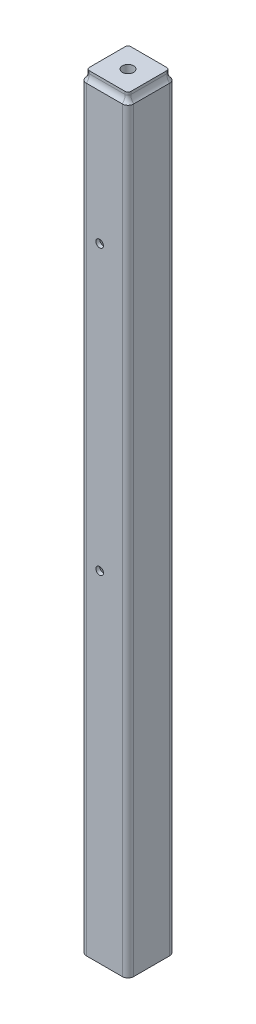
ISO-10303-21;
HEADER;
FILE_DESCRIPTION(('STEP AP214'),'2;1');
FILE_NAME('part.step','',(''),(''),'','','');
FILE_SCHEMA(('AUTOMOTIVE_DESIGN { 1 0 10303 214 1 1 1 1 }'));
ENDSEC;
DATA;
#1=APPLICATION_CONTEXT('core data for automotive mechanical design processes');
#2=APPLICATION_PROTOCOL_DEFINITION('international standard','automotive_design',2000,#1);
#3=PRODUCT_CONTEXT('',#1,'mechanical');
#4=PRODUCT('Part','Part','',(#3));
#5=PRODUCT_RELATED_PRODUCT_CATEGORY('part','',(#4));
#6=PRODUCT_DEFINITION_FORMATION('','',#4);
#7=PRODUCT_DEFINITION_CONTEXT('part definition',#1,'design');
#8=PRODUCT_DEFINITION('design','',#6,#7);
#9=PRODUCT_DEFINITION_SHAPE('','',#8);
#10=(LENGTH_UNIT() NAMED_UNIT(*) SI_UNIT(.MILLI.,.METRE.));
#11=(NAMED_UNIT(*) PLANE_ANGLE_UNIT() SI_UNIT($,.RADIAN.));
#12=(NAMED_UNIT(*) SI_UNIT($,.STERADIAN.) SOLID_ANGLE_UNIT());
#13=UNCERTAINTY_MEASURE_WITH_UNIT(LENGTH_MEASURE(1.E-05),#10,'distance_accuracy_value','');
#14=(GEOMETRIC_REPRESENTATION_CONTEXT(3) GLOBAL_UNCERTAINTY_ASSIGNED_CONTEXT((#13)) GLOBAL_UNIT_ASSIGNED_CONTEXT((#10,
#11,#12)) REPRESENTATION_CONTEXT('',''));
#15=CARTESIAN_POINT('',(0.,0.,0.));
#16=DIRECTION('',(0.,0.,1.));
#17=DIRECTION('',(1.,0.,0.));
#18=AXIS2_PLACEMENT_3D('',#15,#16,#17);
#19=CARTESIAN_POINT('',(-9.5,0.,9.5));
#20=DIRECTION('',(0.,-1.,0.));
#21=DIRECTION('',(0.,0.,-1.));
#22=AXIS2_PLACEMENT_3D('',#19,#20,#21);
#23=PLANE('',#22);
#24=CARTESIAN_POINT('',(-9.5,0.,9.5));
#25=DIRECTION('',(0.,1.,0.));
#26=DIRECTION('',(0.,0.,-1.));
#27=AXIS2_PLACEMENT_3D('',#24,#25,#26);
#28=CIRCLE('',#27,3.);
#29=CARTESIAN_POINT('',(-12.5,0.,9.49999999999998));
#30=VERTEX_POINT('',#29);
#31=CARTESIAN_POINT('',(-9.49999999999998,0.,12.5));
#32=VERTEX_POINT('',#31);
#33=EDGE_CURVE('E290',#30,#32,#28,.T.);
#34=ORIENTED_EDGE('',*,*,#33,.F.);
#35=DIRECTION('',(0.,0.,1.));
#36=VECTOR('',#35,1.);
#37=CARTESIAN_POINT('',(-12.5,0.,9.49999999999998));
#38=LINE('',#37,#36);
#39=CARTESIAN_POINT('',(-12.5,0.,-9.49999999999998));
#40=VERTEX_POINT('',#39);
#41=EDGE_CURVE('E295',#40,#30,#38,.T.);
#42=ORIENTED_EDGE('',*,*,#41,.F.);
#43=CARTESIAN_POINT('',(-9.5,0.,-9.5));
#44=DIRECTION('',(0.,1.,0.));
#45=DIRECTION('',(0.,0.,1.));
#46=AXIS2_PLACEMENT_3D('',#43,#44,#45);
#47=CIRCLE('',#46,3.);
#48=CARTESIAN_POINT('',(-9.49999999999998,0.,-12.5));
#49=VERTEX_POINT('',#48);
#50=EDGE_CURVE('E329',#49,#40,#47,.T.);
#51=ORIENTED_EDGE('',*,*,#50,.F.);
#52=DIRECTION('',(-1.,0.,0.));
#53=VECTOR('',#52,1.);
#54=CARTESIAN_POINT('',(9.49999999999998,0.,-12.5));
#55=LINE('',#54,#53);
#56=CARTESIAN_POINT('',(9.49999999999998,0.,-12.5));
#57=VERTEX_POINT('',#56);
#58=EDGE_CURVE('E327',#57,#49,#55,.T.);
#59=ORIENTED_EDGE('',*,*,#58,.F.);
#60=CARTESIAN_POINT('',(9.5,0.,-9.50000000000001));
#61=DIRECTION('',(0.,1.,0.));
#62=DIRECTION('',(0.,0.,1.));
#63=AXIS2_PLACEMENT_3D('',#60,#61,#62);
#64=CIRCLE('',#63,3.);
#65=CARTESIAN_POINT('',(12.5,0.,-9.49999999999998));
#66=VERTEX_POINT('',#65);
#67=EDGE_CURVE('E325',#66,#57,#64,.T.);
#68=ORIENTED_EDGE('',*,*,#67,.F.);
#69=DIRECTION('',(0.,0.,-1.));
#70=VECTOR('',#69,1.);
#71=CARTESIAN_POINT('',(12.5,0.,9.49999999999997));
#72=LINE('',#71,#70);
#73=CARTESIAN_POINT('',(12.5,0.,9.49999999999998));
#74=VERTEX_POINT('',#73);
#75=EDGE_CURVE('E323',#74,#66,#72,.T.);
#76=ORIENTED_EDGE('',*,*,#75,.F.);
#77=CARTESIAN_POINT('',(9.5,0.,9.5));
#78=DIRECTION('',(0.,1.,0.));
#79=DIRECTION('',(0.,0.,1.));
#80=AXIS2_PLACEMENT_3D('',#77,#78,#79);
#81=CIRCLE('',#80,3.);
#82=CARTESIAN_POINT('',(9.49999999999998,0.,12.5));
#83=VERTEX_POINT('',#82);
#84=EDGE_CURVE('E321',#83,#74,#81,.T.);
#85=ORIENTED_EDGE('',*,*,#84,.F.);
#86=DIRECTION('',(1.,0.,0.));
#87=VECTOR('',#86,1.);
#88=CARTESIAN_POINT('',(9.49999999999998,0.,12.5));
#89=LINE('',#88,#87);
#90=EDGE_CURVE('E319',#32,#83,#89,.T.);
#91=ORIENTED_EDGE('',*,*,#90,.F.);
#92=EDGE_LOOP('',(#34,#42,#51,#59,#68,#76,#85,#91));
#93=FACE_BOUND('',#92,.T.);
#94=DIRECTION('',(0.,0.,1.));
#95=VECTOR('',#94,1.);
#96=CARTESIAN_POINT('',(-10.5,0.,9.49999999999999));
#97=LINE('',#96,#95);
#98=CARTESIAN_POINT('',(-10.5,0.,-9.49999999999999));
#99=VERTEX_POINT('',#98);
#100=CARTESIAN_POINT('',(-10.5,0.,9.49999999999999));
#101=VERTEX_POINT('',#100);
#102=EDGE_CURVE('E232',#99,#101,#97,.T.);
#103=ORIENTED_EDGE('',*,*,#102,.T.);
#104=CARTESIAN_POINT('',(-9.5,0.,9.5));
#105=DIRECTION('',(0.,1.,0.));
#106=DIRECTION('',(0.,0.,-1.));
#107=AXIS2_PLACEMENT_3D('',#104,#105,#106);
#108=CIRCLE('',#107,0.999999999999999);
#109=CARTESIAN_POINT('',(-9.49999999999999,0.,10.5));
#110=VERTEX_POINT('',#109);
#111=EDGE_CURVE('E219',#101,#110,#108,.T.);
#112=ORIENTED_EDGE('',*,*,#111,.T.);
#113=DIRECTION('',(1.,0.,0.));
#114=VECTOR('',#113,1.);
#115=CARTESIAN_POINT('',(-9.49999999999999,0.,10.5));
#116=LINE('',#115,#114);
#117=CARTESIAN_POINT('',(9.49999999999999,0.,10.5));
#118=VERTEX_POINT('',#117);
#119=EDGE_CURVE('E222',#110,#118,#116,.T.);
#120=ORIENTED_EDGE('',*,*,#119,.T.);
#121=CARTESIAN_POINT('',(9.5,0.,9.5));
#122=DIRECTION('',(0.,1.,0.));
#123=DIRECTION('',(0.,0.,1.));
#124=AXIS2_PLACEMENT_3D('',#121,#122,#123);
#125=CIRCLE('',#124,0.999999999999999);
#126=CARTESIAN_POINT('',(10.5,0.,9.49999999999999));
#127=VERTEX_POINT('',#126);
#128=EDGE_CURVE('E256',#118,#127,#125,.T.);
#129=ORIENTED_EDGE('',*,*,#128,.T.);
#130=DIRECTION('',(0.,0.,-1.));
#131=VECTOR('',#130,1.);
#132=CARTESIAN_POINT('',(10.5,0.,9.49999999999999));
#133=LINE('',#132,#131);
#134=CARTESIAN_POINT('',(10.5,0.,-9.49999999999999));
#135=VERTEX_POINT('',#134);
#136=EDGE_CURVE('E259',#127,#135,#133,.T.);
#137=ORIENTED_EDGE('',*,*,#136,.T.);
#138=CARTESIAN_POINT('',(9.5,0.,-9.5));
#139=DIRECTION('',(0.,1.,0.));
#140=DIRECTION('',(0.,0.,-1.));
#141=AXIS2_PLACEMENT_3D('',#138,#139,#140);
#142=CIRCLE('',#141,1.);
#143=CARTESIAN_POINT('',(9.49999999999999,0.,-10.5));
#144=VERTEX_POINT('',#143);
#145=EDGE_CURVE('E262',#135,#144,#142,.T.);
#146=ORIENTED_EDGE('',*,*,#145,.T.);
#147=DIRECTION('',(-1.,0.,0.));
#148=VECTOR('',#147,1.);
#149=CARTESIAN_POINT('',(-9.49999999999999,0.,-10.5));
#150=LINE('',#149,#148);
#151=CARTESIAN_POINT('',(-9.49999999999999,0.,-10.5));
#152=VERTEX_POINT('',#151);
#153=EDGE_CURVE('E265',#144,#152,#150,.T.);
#154=ORIENTED_EDGE('',*,*,#153,.T.);
#155=CARTESIAN_POINT('',(-9.5,0.,-9.5));
#156=DIRECTION('',(0.,1.,0.));
#157=DIRECTION('',(0.,0.,-1.));
#158=AXIS2_PLACEMENT_3D('',#155,#156,#157);
#159=CIRCLE('',#158,0.999999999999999);
#160=EDGE_CURVE('E268',#152,#99,#159,.T.);
#161=ORIENTED_EDGE('',*,*,#160,.T.);
#162=EDGE_LOOP('',(#103,#112,#120,#129,#137,#146,#154,#161));
#163=FACE_BOUND('',#162,.T.);
#164=ADVANCED_FACE('F30',(#93,#163),#23,.T.);
#165=CARTESIAN_POINT('',(-9.5,400.,9.5));
#166=DIRECTION('',(0.,-1.,0.));
#167=DIRECTION('',(0.,0.,-1.));
#168=AXIS2_PLACEMENT_3D('',#165,#166,#167);
#169=CYLINDRICAL_SURFACE('',#168,3.);
#170=ORIENTED_EDGE('',*,*,#33,.T.);
#171=DIRECTION('',(0.,-1.,0.));
#172=VECTOR('',#171,1.);
#173=CARTESIAN_POINT('',(-9.49999999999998,400.,12.5));
#174=LINE('',#173,#172);
#175=CARTESIAN_POINT('',(-9.49999999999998,400.,12.5));
#176=VERTEX_POINT('',#175);
#177=EDGE_CURVE('E352',#176,#32,#174,.T.);
#178=ORIENTED_EDGE('',*,*,#177,.F.);
#179=CARTESIAN_POINT('',(-9.5,400.,9.5));
#180=DIRECTION('',(0.,1.,0.));
#181=DIRECTION('',(0.,0.,-1.));
#182=AXIS2_PLACEMENT_3D('',#179,#180,#181);
#183=CIRCLE('',#182,3.);
#184=CARTESIAN_POINT('',(-12.5,400.,9.49999999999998));
#185=VERTEX_POINT('',#184);
#186=EDGE_CURVE('E291',#185,#176,#183,.T.);
#187=ORIENTED_EDGE('',*,*,#186,.F.);
#188=DIRECTION('',(0.,-1.,0.));
#189=VECTOR('',#188,1.);
#190=CARTESIAN_POINT('',(-12.5,400.,9.49999999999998));
#191=LINE('',#190,#189);
#192=EDGE_CURVE('E316',#185,#30,#191,.T.);
#193=ORIENTED_EDGE('',*,*,#192,.T.);
#194=EDGE_LOOP('',(#170,#178,#187,#193));
#195=FACE_BOUND('',#194,.T.);
#196=ADVANCED_FACE('F493',(#195),#169,.T.);
#197=CARTESIAN_POINT('',(9.49999999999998,400.,12.5));
#198=DIRECTION('',(0.,0.,-1.));
#199=DIRECTION('',(-1.,0.,0.));
#200=AXIS2_PLACEMENT_3D('',#197,#198,#199);
#201=PLANE('',#200);
#202=CARTESIAN_POINT('',(-2.49999999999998,180.,12.5));
#203=DIRECTION('',(0.,0.,1.));
#204=DIRECTION('',(-1.,0.,0.));
#205=AXIS2_PLACEMENT_3D('',#202,#203,#204);
#206=CIRCLE('',#205,2.);
#207=CARTESIAN_POINT('',(-4.49999999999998,180.,12.5));
#208=VERTEX_POINT('',#207);
#209=EDGE_CURVE('E410',#208,#208,#206,.T.);
#210=ORIENTED_EDGE('',*,*,#209,.F.);
#211=EDGE_LOOP('',(#210));
#212=FACE_BOUND('',#211,.T.);
#213=CARTESIAN_POINT('',(-2.49999999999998,330.,12.5));
#214=DIRECTION('',(0.,0.,1.));
#215=DIRECTION('',(1.,0.,0.));
#216=AXIS2_PLACEMENT_3D('',#213,#214,#215);
#217=CIRCLE('',#216,2.);
#218=CARTESIAN_POINT('',(-0.499999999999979,330.,12.5));
#219=VERTEX_POINT('',#218);
#220=EDGE_CURVE('E400',#219,#219,#217,.T.);
#221=ORIENTED_EDGE('',*,*,#220,.F.);
#222=EDGE_LOOP('',(#221));
#223=FACE_BOUND('',#222,.T.);
#224=ORIENTED_EDGE('',*,*,#90,.T.);
#225=DIRECTION('',(0.,-1.,0.));
#226=VECTOR('',#225,1.);
#227=CARTESIAN_POINT('',(9.49999999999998,400.,12.5));
#228=LINE('',#227,#226);
#229=CARTESIAN_POINT('',(9.49999999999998,400.,12.5));
#230=VERTEX_POINT('',#229);
#231=EDGE_CURVE('E349',#230,#83,#228,.T.);
#232=ORIENTED_EDGE('',*,*,#231,.F.);
#233=DIRECTION('',(1.,0.,0.));
#234=VECTOR('',#233,1.);
#235=CARTESIAN_POINT('',(9.49999999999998,400.,12.5));
#236=LINE('',#235,#234);
#237=EDGE_CURVE('E294',#176,#230,#236,.T.);
#238=ORIENTED_EDGE('',*,*,#237,.F.);
#239=ORIENTED_EDGE('',*,*,#177,.T.);
#240=EDGE_LOOP('',(#224,#232,#238,#239));
#241=FACE_BOUND('',#240,.T.);
#242=ADVANCED_FACE('F499',(#212,#223,#241),#201,.F.);
#243=CARTESIAN_POINT('',(9.5,400.,9.5));
#244=DIRECTION('',(0.,-1.,0.));
#245=DIRECTION('',(0.,0.,-1.));
#246=AXIS2_PLACEMENT_3D('',#243,#244,#245);
#247=CYLINDRICAL_SURFACE('',#246,3.);
#248=ORIENTED_EDGE('',*,*,#84,.T.);
#249=DIRECTION('',(0.,-1.,0.));
#250=VECTOR('',#249,1.);
#251=CARTESIAN_POINT('',(12.5,400.,9.49999999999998));
#252=LINE('',#251,#250);
#253=CARTESIAN_POINT('',(12.5,400.,9.49999999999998));
#254=VERTEX_POINT('',#253);
#255=EDGE_CURVE('E346',#254,#74,#252,.T.);
#256=ORIENTED_EDGE('',*,*,#255,.F.);
#257=CARTESIAN_POINT('',(9.5,400.,9.5));
#258=DIRECTION('',(0.,1.,0.));
#259=DIRECTION('',(0.,0.,1.));
#260=AXIS2_PLACEMENT_3D('',#257,#258,#259);
#261=CIRCLE('',#260,3.);
#262=EDGE_CURVE('E298',#230,#254,#261,.T.);
#263=ORIENTED_EDGE('',*,*,#262,.F.);
#264=ORIENTED_EDGE('',*,*,#231,.T.);
#265=EDGE_LOOP('',(#248,#256,#263,#264));
#266=FACE_BOUND('',#265,.T.);
#267=ADVANCED_FACE('F527',(#266),#247,.T.);
#268=CARTESIAN_POINT('',(12.5,400.,9.49999999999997));
#269=DIRECTION('',(-1.,0.,0.));
#270=DIRECTION('',(0.,0.,1.));
#271=AXIS2_PLACEMENT_3D('',#268,#269,#270);
#272=PLANE('',#271);
#273=ORIENTED_EDGE('',*,*,#75,.T.);
#274=DIRECTION('',(0.,-1.,0.));
#275=VECTOR('',#274,1.);
#276=CARTESIAN_POINT('',(12.5,400.,-9.49999999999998));
#277=LINE('',#276,#275);
#278=CARTESIAN_POINT('',(12.5,400.,-9.49999999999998));
#279=VERTEX_POINT('',#278);
#280=EDGE_CURVE('E343',#279,#66,#277,.T.);
#281=ORIENTED_EDGE('',*,*,#280,.F.);
#282=DIRECTION('',(0.,0.,-1.));
#283=VECTOR('',#282,1.);
#284=CARTESIAN_POINT('',(12.5,400.,9.49999999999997));
#285=LINE('',#284,#283);
#286=EDGE_CURVE('E301',#254,#279,#285,.T.);
#287=ORIENTED_EDGE('',*,*,#286,.F.);
#288=ORIENTED_EDGE('',*,*,#255,.T.);
#289=EDGE_LOOP('',(#273,#281,#287,#288));
#290=FACE_BOUND('',#289,.T.);
#291=ADVANCED_FACE('F523',(#290),#272,.F.);
#292=CARTESIAN_POINT('',(9.5,400.,-9.50000000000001));
#293=DIRECTION('',(0.,-1.,0.));
#294=DIRECTION('',(0.,0.,-1.));
#295=AXIS2_PLACEMENT_3D('',#292,#293,#294);
#296=CYLINDRICAL_SURFACE('',#295,3.);
#297=ORIENTED_EDGE('',*,*,#67,.T.);
#298=DIRECTION('',(0.,-1.,0.));
#299=VECTOR('',#298,1.);
#300=CARTESIAN_POINT('',(9.49999999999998,400.,-12.5));
#301=LINE('',#300,#299);
#302=CARTESIAN_POINT('',(9.49999999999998,400.,-12.5));
#303=VERTEX_POINT('',#302);
#304=EDGE_CURVE('E340',#303,#57,#301,.T.);
#305=ORIENTED_EDGE('',*,*,#304,.F.);
#306=CARTESIAN_POINT('',(9.5,400.,-9.50000000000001));
#307=DIRECTION('',(0.,1.,0.));
#308=DIRECTION('',(0.,0.,1.));
#309=AXIS2_PLACEMENT_3D('',#306,#307,#308);
#310=CIRCLE('',#309,3.);
#311=EDGE_CURVE('E304',#279,#303,#310,.T.);
#312=ORIENTED_EDGE('',*,*,#311,.F.);
#313=ORIENTED_EDGE('',*,*,#280,.T.);
#314=EDGE_LOOP('',(#297,#305,#312,#313));
#315=FACE_BOUND('',#314,.T.);
#316=ADVANCED_FACE('F519',(#315),#296,.T.);
#317=CARTESIAN_POINT('',(9.49999999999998,400.,-12.5));
#318=DIRECTION('',(0.,0.,1.));
#319=DIRECTION('',(1.,0.,0.));
#320=AXIS2_PLACEMENT_3D('',#317,#318,#319);
#321=PLANE('',#320);
#322=ORIENTED_EDGE('',*,*,#58,.T.);
#323=DIRECTION('',(0.,-1.,0.));
#324=VECTOR('',#323,1.);
#325=CARTESIAN_POINT('',(-9.49999999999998,400.,-12.5));
#326=LINE('',#325,#324);
#327=CARTESIAN_POINT('',(-9.49999999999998,400.,-12.5));
#328=VERTEX_POINT('',#327);
#329=EDGE_CURVE('E337',#328,#49,#326,.T.);
#330=ORIENTED_EDGE('',*,*,#329,.F.);
#331=DIRECTION('',(-1.,0.,0.));
#332=VECTOR('',#331,1.);
#333=CARTESIAN_POINT('',(9.49999999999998,400.,-12.5));
#334=LINE('',#333,#332);
#335=EDGE_CURVE('E307',#303,#328,#334,.T.);
#336=ORIENTED_EDGE('',*,*,#335,.F.);
#337=ORIENTED_EDGE('',*,*,#304,.T.);
#338=EDGE_LOOP('',(#322,#330,#336,#337));
#339=FACE_BOUND('',#338,.T.);
#340=ADVANCED_FACE('F515',(#339),#321,.F.);
#341=CARTESIAN_POINT('',(-9.5,400.,-9.5));
#342=DIRECTION('',(0.,-1.,0.));
#343=DIRECTION('',(0.,0.,-1.));
#344=AXIS2_PLACEMENT_3D('',#341,#342,#343);
#345=CYLINDRICAL_SURFACE('',#344,3.);
#346=ORIENTED_EDGE('',*,*,#50,.T.);
#347=DIRECTION('',(0.,-1.,0.));
#348=VECTOR('',#347,1.);
#349=CARTESIAN_POINT('',(-12.5,400.,-9.49999999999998));
#350=LINE('',#349,#348);
#351=CARTESIAN_POINT('',(-12.5,400.,-9.49999999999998));
#352=VERTEX_POINT('',#351);
#353=EDGE_CURVE('E334',#352,#40,#350,.T.);
#354=ORIENTED_EDGE('',*,*,#353,.F.);
#355=CARTESIAN_POINT('',(-9.5,400.,-9.5));
#356=DIRECTION('',(0.,1.,0.));
#357=DIRECTION('',(0.,0.,1.));
#358=AXIS2_PLACEMENT_3D('',#355,#356,#357);
#359=CIRCLE('',#358,3.);
#360=EDGE_CURVE('E310',#328,#352,#359,.T.);
#361=ORIENTED_EDGE('',*,*,#360,.F.);
#362=ORIENTED_EDGE('',*,*,#329,.T.);
#363=EDGE_LOOP('',(#346,#354,#361,#362));
#364=FACE_BOUND('',#363,.T.);
#365=ADVANCED_FACE('F511',(#364),#345,.T.);
#366=CARTESIAN_POINT('',(-12.5,400.,9.49999999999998));
#367=DIRECTION('',(1.,0.,0.));
#368=DIRECTION('',(0.,0.,-1.));
#369=AXIS2_PLACEMENT_3D('',#366,#367,#368);
#370=PLANE('',#369);
#371=CARTESIAN_POINT('',(-12.5,180.,2.50000000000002));
#372=DIRECTION('',(-1.,0.,0.));
#373=DIRECTION('',(0.,0.,-1.));
#374=AXIS2_PLACEMENT_3D('',#371,#372,#373);
#375=CIRCLE('',#374,1.99999999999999);
#376=CARTESIAN_POINT('',(-12.5,180.,0.500000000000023));
#377=VERTEX_POINT('',#376);
#378=EDGE_CURVE('E397',#377,#377,#375,.T.);
#379=ORIENTED_EDGE('',*,*,#378,.F.);
#380=EDGE_LOOP('',(#379));
#381=FACE_BOUND('',#380,.T.);
#382=CARTESIAN_POINT('',(-12.5,330.,2.5));
#383=DIRECTION('',(-1.,0.,0.));
#384=DIRECTION('',(0.,0.,1.));
#385=AXIS2_PLACEMENT_3D('',#382,#383,#384);
#386=CIRCLE('',#385,2.);
#387=CARTESIAN_POINT('',(-12.5,330.,4.5));
#388=VERTEX_POINT('',#387);
#389=EDGE_CURVE('E394',#388,#388,#386,.T.);
#390=ORIENTED_EDGE('',*,*,#389,.F.);
#391=EDGE_LOOP('',(#390));
#392=FACE_BOUND('',#391,.T.);
#393=ORIENTED_EDGE('',*,*,#41,.T.);
#394=ORIENTED_EDGE('',*,*,#192,.F.);
#395=DIRECTION('',(0.,0.,1.));
#396=VECTOR('',#395,1.);
#397=CARTESIAN_POINT('',(-12.5,400.,9.49999999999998));
#398=LINE('',#397,#396);
#399=EDGE_CURVE('E313',#352,#185,#398,.T.);
#400=ORIENTED_EDGE('',*,*,#399,.F.);
#401=ORIENTED_EDGE('',*,*,#353,.T.);
#402=EDGE_LOOP('',(#393,#394,#400,#401));
#403=FACE_BOUND('',#402,.T.);
#404=ADVANCED_FACE('F508',(#381,#392,#403),#370,.F.);
#405=CARTESIAN_POINT('',(-9.5,400.,9.5));
#406=DIRECTION('',(0.,-1.,0.));
#407=DIRECTION('',(0.,0.,-1.));
#408=AXIS2_PLACEMENT_3D('',#405,#406,#407);
#409=CYLINDRICAL_SURFACE('',#408,0.999999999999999);
#410=ORIENTED_EDGE('',*,*,#111,.F.);
#411=DIRECTION('',(0.,-1.,0.));
#412=VECTOR('',#411,1.);
#413=CARTESIAN_POINT('',(-10.5,400.,9.49999999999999));
#414=LINE('',#413,#412);
#415=CARTESIAN_POINT('',(-10.5,400.,9.49999999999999));
#416=VERTEX_POINT('',#415);
#417=EDGE_CURVE('E252',#416,#101,#414,.T.);
#418=ORIENTED_EDGE('',*,*,#417,.F.);
#419=CARTESIAN_POINT('',(-9.5,400.,9.5));
#420=DIRECTION('',(0.,1.,0.));
#421=DIRECTION('',(0.,0.,-1.));
#422=AXIS2_PLACEMENT_3D('',#419,#420,#421);
#423=CIRCLE('',#422,0.999999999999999);
#424=CARTESIAN_POINT('',(-9.49999999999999,400.,10.5));
#425=VERTEX_POINT('',#424);
#426=EDGE_CURVE('E228',#416,#425,#423,.T.);
#427=ORIENTED_EDGE('',*,*,#426,.T.);
#428=DIRECTION('',(0.,-1.,0.));
#429=VECTOR('',#428,1.);
#430=CARTESIAN_POINT('',(-9.49999999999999,400.,10.5));
#431=LINE('',#430,#429);
#432=EDGE_CURVE('E287',#425,#110,#431,.T.);
#433=ORIENTED_EDGE('',*,*,#432,.T.);
#434=EDGE_LOOP('',(#410,#418,#427,#433));
#435=FACE_BOUND('',#434,.T.);
#436=ADVANCED_FACE('F506',(#435),#409,.F.);
#437=CARTESIAN_POINT('',(-9.49999999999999,400.,10.5));
#438=DIRECTION('',(0.,0.,-1.));
#439=DIRECTION('',(-1.,0.,0.));
#440=AXIS2_PLACEMENT_3D('',#437,#438,#439);
#441=PLANE('',#440);
#442=CARTESIAN_POINT('',(-2.49999999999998,180.,10.5));
#443=DIRECTION('',(0.,0.,-1.));
#444=DIRECTION('',(-1.,0.,0.));
#445=AXIS2_PLACEMENT_3D('',#442,#443,#444);
#446=CIRCLE('',#445,2.);
#447=CARTESIAN_POINT('',(-4.49999999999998,180.,10.5));
#448=VERTEX_POINT('',#447);
#449=EDGE_CURVE('E34',#448,#448,#446,.T.);
#450=ORIENTED_EDGE('',*,*,#449,.F.);
#451=EDGE_LOOP('',(#450));
#452=FACE_BOUND('',#451,.T.);
#453=CARTESIAN_POINT('',(-2.49999999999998,330.,10.5));
#454=DIRECTION('',(0.,0.,-1.));
#455=DIRECTION('',(-1.,0.,0.));
#456=AXIS2_PLACEMENT_3D('',#453,#454,#455);
#457=CIRCLE('',#456,2.);
#458=CARTESIAN_POINT('',(-4.49999999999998,330.,10.5));
#459=VERTEX_POINT('',#458);
#460=EDGE_CURVE('E398',#459,#459,#457,.T.);
#461=ORIENTED_EDGE('',*,*,#460,.F.);
#462=EDGE_LOOP('',(#461));
#463=FACE_BOUND('',#462,.T.);
#464=ORIENTED_EDGE('',*,*,#119,.F.);
#465=ORIENTED_EDGE('',*,*,#432,.F.);
#466=DIRECTION('',(1.,0.,0.));
#467=VECTOR('',#466,1.);
#468=CARTESIAN_POINT('',(-9.49999999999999,400.,10.5));
#469=LINE('',#468,#467);
#470=CARTESIAN_POINT('',(9.5,400.,10.5));
#471=VERTEX_POINT('',#470);
#472=EDGE_CURVE('E231',#425,#471,#469,.T.);
#473=ORIENTED_EDGE('',*,*,#472,.T.);
#474=DIRECTION('',(0.,-1.,0.));
#475=VECTOR('',#474,1.);
#476=CARTESIAN_POINT('',(9.49999999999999,400.,10.5));
#477=LINE('',#476,#475);
#478=EDGE_CURVE('E285',#471,#118,#477,.T.);
#479=ORIENTED_EDGE('',*,*,#478,.T.);
#480=EDGE_LOOP('',(#464,#465,#473,#479));
#481=FACE_BOUND('',#480,.T.);
#482=ADVANCED_FACE('F694',(#452,#463,#481),#441,.T.);
#483=CARTESIAN_POINT('',(9.5,400.,9.5));
#484=DIRECTION('',(0.,-1.,0.));
#485=DIRECTION('',(0.,0.,-1.));
#486=AXIS2_PLACEMENT_3D('',#483,#484,#485);
#487=CYLINDRICAL_SURFACE('',#486,0.999999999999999);
#488=ORIENTED_EDGE('',*,*,#128,.F.);
#489=ORIENTED_EDGE('',*,*,#478,.F.);
#490=CARTESIAN_POINT('',(9.5,400.,9.5));
#491=DIRECTION('',(0.,1.,0.));
#492=DIRECTION('',(0.,0.,1.));
#493=AXIS2_PLACEMENT_3D('',#490,#491,#492);
#494=CIRCLE('',#493,0.999999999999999);
#495=CARTESIAN_POINT('',(10.5,400.,9.49999999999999));
#496=VERTEX_POINT('',#495);
#497=EDGE_CURVE('E235',#471,#496,#494,.T.);
#498=ORIENTED_EDGE('',*,*,#497,.T.);
#499=DIRECTION('',(0.,-1.,0.));
#500=VECTOR('',#499,1.);
#501=CARTESIAN_POINT('',(10.5,400.,9.49999999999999));
#502=LINE('',#501,#500);
#503=EDGE_CURVE('E283',#496,#127,#502,.T.);
#504=ORIENTED_EDGE('',*,*,#503,.T.);
#505=EDGE_LOOP('',(#488,#489,#498,#504));
#506=FACE_BOUND('',#505,.T.);
#507=ADVANCED_FACE('F691',(#506),#487,.F.);
#508=CARTESIAN_POINT('',(10.5,400.,9.49999999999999));
#509=DIRECTION('',(-1.,0.,0.));
#510=DIRECTION('',(0.,0.,1.));
#511=AXIS2_PLACEMENT_3D('',#508,#509,#510);
#512=PLANE('',#511);
#513=ORIENTED_EDGE('',*,*,#136,.F.);
#514=ORIENTED_EDGE('',*,*,#503,.F.);
#515=DIRECTION('',(0.,0.,-1.));
#516=VECTOR('',#515,1.);
#517=CARTESIAN_POINT('',(10.5,400.,9.49999999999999));
#518=LINE('',#517,#516);
#519=CARTESIAN_POINT('',(10.5,400.,-9.49999999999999));
#520=VERTEX_POINT('',#519);
#521=EDGE_CURVE('E238',#496,#520,#518,.T.);
#522=ORIENTED_EDGE('',*,*,#521,.T.);
#523=DIRECTION('',(0.,-1.,0.));
#524=VECTOR('',#523,1.);
#525=CARTESIAN_POINT('',(10.5,400.,-9.49999999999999));
#526=LINE('',#525,#524);
#527=EDGE_CURVE('E281',#520,#135,#526,.T.);
#528=ORIENTED_EDGE('',*,*,#527,.T.);
#529=EDGE_LOOP('',(#513,#514,#522,#528));
#530=FACE_BOUND('',#529,.T.);
#531=ADVANCED_FACE('F687',(#530),#512,.T.);
#532=CARTESIAN_POINT('',(9.5,400.,-9.5));
#533=DIRECTION('',(0.,-1.,0.));
#534=DIRECTION('',(0.,0.,-1.));
#535=AXIS2_PLACEMENT_3D('',#532,#533,#534);
#536=CYLINDRICAL_SURFACE('',#535,1.);
#537=ORIENTED_EDGE('',*,*,#145,.F.);
#538=ORIENTED_EDGE('',*,*,#527,.F.);
#539=CARTESIAN_POINT('',(9.5,400.,-9.5));
#540=DIRECTION('',(0.,1.,0.));
#541=DIRECTION('',(0.,0.,-1.));
#542=AXIS2_PLACEMENT_3D('',#539,#540,#541);
#543=CIRCLE('',#542,1.);
#544=CARTESIAN_POINT('',(9.49999999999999,400.,-10.5));
#545=VERTEX_POINT('',#544);
#546=EDGE_CURVE('E241',#520,#545,#543,.T.);
#547=ORIENTED_EDGE('',*,*,#546,.T.);
#548=DIRECTION('',(0.,-1.,0.));
#549=VECTOR('',#548,1.);
#550=CARTESIAN_POINT('',(9.49999999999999,400.,-10.5));
#551=LINE('',#550,#549);
#552=EDGE_CURVE('E279',#545,#144,#551,.T.);
#553=ORIENTED_EDGE('',*,*,#552,.T.);
#554=EDGE_LOOP('',(#537,#538,#547,#553));
#555=FACE_BOUND('',#554,.T.);
#556=ADVANCED_FACE('F683',(#555),#536,.F.);
#557=CARTESIAN_POINT('',(-9.49999999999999,400.,-10.5));
#558=DIRECTION('',(0.,0.,1.));
#559=DIRECTION('',(1.,0.,0.));
#560=AXIS2_PLACEMENT_3D('',#557,#558,#559);
#561=PLANE('',#560);
#562=ORIENTED_EDGE('',*,*,#153,.F.);
#563=ORIENTED_EDGE('',*,*,#552,.F.);
#564=DIRECTION('',(-1.,0.,0.));
#565=VECTOR('',#564,1.);
#566=CARTESIAN_POINT('',(-9.49999999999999,400.,-10.5));
#567=LINE('',#566,#565);
#568=CARTESIAN_POINT('',(-9.49999999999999,400.,-10.5));
#569=VERTEX_POINT('',#568);
#570=EDGE_CURVE('E244',#545,#569,#567,.T.);
#571=ORIENTED_EDGE('',*,*,#570,.T.);
#572=DIRECTION('',(0.,-1.,0.));
#573=VECTOR('',#572,1.);
#574=CARTESIAN_POINT('',(-9.49999999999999,400.,-10.5));
#575=LINE('',#574,#573);
#576=EDGE_CURVE('E277',#569,#152,#575,.T.);
#577=ORIENTED_EDGE('',*,*,#576,.T.);
#578=EDGE_LOOP('',(#562,#563,#571,#577));
#579=FACE_BOUND('',#578,.T.);
#580=ADVANCED_FACE('F679',(#579),#561,.T.);
#581=CARTESIAN_POINT('',(-9.5,400.,-9.5));
#582=DIRECTION('',(0.,-1.,0.));
#583=DIRECTION('',(0.,0.,-1.));
#584=AXIS2_PLACEMENT_3D('',#581,#582,#583);
#585=CYLINDRICAL_SURFACE('',#584,0.999999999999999);
#586=ORIENTED_EDGE('',*,*,#160,.F.);
#587=ORIENTED_EDGE('',*,*,#576,.F.);
#588=CARTESIAN_POINT('',(-9.5,400.,-9.5));
#589=DIRECTION('',(0.,1.,0.));
#590=DIRECTION('',(0.,0.,-1.));
#591=AXIS2_PLACEMENT_3D('',#588,#589,#590);
#592=CIRCLE('',#591,0.999999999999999);
#593=CARTESIAN_POINT('',(-10.5,400.,-9.49999999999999));
#594=VERTEX_POINT('',#593);
#595=EDGE_CURVE('E247',#569,#594,#592,.T.);
#596=ORIENTED_EDGE('',*,*,#595,.T.);
#597=DIRECTION('',(0.,-1.,0.));
#598=VECTOR('',#597,1.);
#599=CARTESIAN_POINT('',(-10.5,400.,-9.49999999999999));
#600=LINE('',#599,#598);
#601=EDGE_CURVE('E275',#594,#99,#600,.T.);
#602=ORIENTED_EDGE('',*,*,#601,.T.);
#603=EDGE_LOOP('',(#586,#587,#596,#602));
#604=FACE_BOUND('',#603,.T.);
#605=ADVANCED_FACE('F675',(#604),#585,.F.);
#606=CARTESIAN_POINT('',(-10.5,400.,9.49999999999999));
#607=DIRECTION('',(1.,0.,0.));
#608=DIRECTION('',(0.,0.,-1.));
#609=AXIS2_PLACEMENT_3D('',#606,#607,#608);
#610=PLANE('',#609);
#611=CARTESIAN_POINT('',(-10.5,180.,2.50000000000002));
#612=DIRECTION('',(1.,0.,0.));
#613=DIRECTION('',(0.,0.,-1.));
#614=AXIS2_PLACEMENT_3D('',#611,#612,#613);
#615=CIRCLE('',#614,1.99999999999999);
#616=CARTESIAN_POINT('',(-10.5,180.,0.500000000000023));
#617=VERTEX_POINT('',#616);
#618=EDGE_CURVE('E395',#617,#617,#615,.T.);
#619=ORIENTED_EDGE('',*,*,#618,.F.);
#620=EDGE_LOOP('',(#619));
#621=FACE_BOUND('',#620,.T.);
#622=CARTESIAN_POINT('',(-10.5,330.,2.5));
#623=DIRECTION('',(1.,0.,0.));
#624=DIRECTION('',(0.,0.,-1.));
#625=AXIS2_PLACEMENT_3D('',#622,#623,#624);
#626=CIRCLE('',#625,2.);
#627=CARTESIAN_POINT('',(-10.5,330.,0.499999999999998));
#628=VERTEX_POINT('',#627);
#629=EDGE_CURVE('E371',#628,#628,#626,.T.);
#630=ORIENTED_EDGE('',*,*,#629,.F.);
#631=EDGE_LOOP('',(#630));
#632=FACE_BOUND('',#631,.T.);
#633=ORIENTED_EDGE('',*,*,#102,.F.);
#634=ORIENTED_EDGE('',*,*,#601,.F.);
#635=DIRECTION('',(0.,0.,1.));
#636=VECTOR('',#635,1.);
#637=CARTESIAN_POINT('',(-10.5,400.,9.49999999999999));
#638=LINE('',#637,#636);
#639=EDGE_CURVE('E250',#594,#416,#638,.T.);
#640=ORIENTED_EDGE('',*,*,#639,.T.);
#641=ORIENTED_EDGE('',*,*,#417,.T.);
#642=EDGE_LOOP('',(#633,#634,#640,#641));
#643=FACE_BOUND('',#642,.T.);
#644=ADVANCED_FACE('F672',(#621,#632,#643),#610,.T.);
#645=CARTESIAN_POINT('',(-9.5,405.,-9.50000000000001));
#646=DIRECTION('',(0.,1.,0.));
#647=DIRECTION('',(0.,0.,1.));
#648=AXIS2_PLACEMENT_3D('',#645,#646,#647);
#649=PLANE('',#648);
#650=CARTESIAN_POINT('',(-9.5,405.,-9.50000000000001));
#651=DIRECTION('',(0.,1.,0.));
#652=DIRECTION('',(0.,0.,1.));
#653=AXIS2_PLACEMENT_3D('',#650,#651,#652);
#654=CIRCLE('',#653,1.5);
#655=CARTESIAN_POINT('',(-9.49999999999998,405.,-11.));
#656=VERTEX_POINT('',#655);
#657=CARTESIAN_POINT('',(-11.,405.,-9.49999999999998));
#658=VERTEX_POINT('',#657);
#659=EDGE_CURVE('E204',#656,#658,#654,.T.);
#660=ORIENTED_EDGE('',*,*,#659,.T.);
#661=DIRECTION('',(0.,0.,1.));
#662=VECTOR('',#661,1.);
#663=CARTESIAN_POINT('',(-11.,405.,-9.49999999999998));
#664=LINE('',#663,#662);
#665=CARTESIAN_POINT('',(-11.,405.,9.49999999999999));
#666=VERTEX_POINT('',#665);
#667=EDGE_CURVE('E193',#658,#666,#664,.T.);
#668=ORIENTED_EDGE('',*,*,#667,.T.);
#669=CARTESIAN_POINT('',(-9.5,405.,9.5));
#670=DIRECTION('',(0.,1.,0.));
#671=DIRECTION('',(0.,0.,1.));
#672=AXIS2_PLACEMENT_3D('',#669,#670,#671);
#673=CIRCLE('',#672,1.5);
#674=CARTESIAN_POINT('',(-9.49999999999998,405.,11.));
#675=VERTEX_POINT('',#674);
#676=EDGE_CURVE('E203',#666,#675,#673,.T.);
#677=ORIENTED_EDGE('',*,*,#676,.T.);
#678=DIRECTION('',(1.,0.,0.));
#679=VECTOR('',#678,1.);
#680=CARTESIAN_POINT('',(-9.49999999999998,405.,11.));
#681=LINE('',#680,#679);
#682=CARTESIAN_POINT('',(9.49999999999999,405.,11.));
#683=VERTEX_POINT('',#682);
#684=EDGE_CURVE('E420',#675,#683,#681,.T.);
#685=ORIENTED_EDGE('',*,*,#684,.T.);
#686=CARTESIAN_POINT('',(9.5,405.,9.5));
#687=DIRECTION('',(0.,1.,0.));
#688=DIRECTION('',(0.,0.,1.));
#689=AXIS2_PLACEMENT_3D('',#686,#687,#688);
#690=CIRCLE('',#689,1.5);
#691=CARTESIAN_POINT('',(11.,405.,9.49999999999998));
#692=VERTEX_POINT('',#691);
#693=EDGE_CURVE('E422',#683,#692,#690,.T.);
#694=ORIENTED_EDGE('',*,*,#693,.T.);
#695=DIRECTION('',(0.,0.,-1.));
#696=VECTOR('',#695,1.);
#697=CARTESIAN_POINT('',(11.,405.,-9.49999999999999));
#698=LINE('',#697,#696);
#699=CARTESIAN_POINT('',(11.,405.,-9.49999999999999));
#700=VERTEX_POINT('',#699);
#701=EDGE_CURVE('E424',#692,#700,#698,.T.);
#702=ORIENTED_EDGE('',*,*,#701,.T.);
#703=CARTESIAN_POINT('',(9.5,405.,-9.50000000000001));
#704=DIRECTION('',(0.,1.,0.));
#705=DIRECTION('',(0.,0.,-1.));
#706=AXIS2_PLACEMENT_3D('',#703,#704,#705);
#707=CIRCLE('',#706,1.5);
#708=CARTESIAN_POINT('',(9.49999999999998,405.,-11.));
#709=VERTEX_POINT('',#708);
#710=EDGE_CURVE('E426',#700,#709,#707,.T.);
#711=ORIENTED_EDGE('',*,*,#710,.T.);
#712=DIRECTION('',(-1.,0.,0.));
#713=VECTOR('',#712,1.);
#714=CARTESIAN_POINT('',(-9.49999999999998,405.,-11.));
#715=LINE('',#714,#713);
#716=EDGE_CURVE('E210',#709,#656,#715,.T.);
#717=ORIENTED_EDGE('',*,*,#716,.T.);
#718=EDGE_LOOP('',(#660,#668,#677,#685,#694,#702,#711,#717));
#719=FACE_BOUND('',#718,.T.);
#720=CARTESIAN_POINT('',(0.,405.,0.));
#721=DIRECTION('',(0.,1.,0.));
#722=DIRECTION('',(0.,0.,1.));
#723=AXIS2_PLACEMENT_3D('',#720,#721,#722);
#724=CIRCLE('',#723,3.);
#725=CARTESIAN_POINT('',(0.,405.,3.));
#726=VERTEX_POINT('',#725);
#727=EDGE_CURVE('E214',#726,#726,#724,.T.);
#728=ORIENTED_EDGE('',*,*,#727,.F.);
#729=EDGE_LOOP('',(#728));
#730=FACE_BOUND('',#729,.T.);
#731=ADVANCED_FACE('F207',(#719,#730),#649,.T.);
#732=CARTESIAN_POINT('',(-9.5,400.,-9.50000000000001));
#733=DIRECTION('',(0.,1.,0.));
#734=DIRECTION('',(0.,0.,1.));
#735=AXIS2_PLACEMENT_3D('',#732,#733,#734);
#736=PLANE('',#735);
#737=ORIENTED_EDGE('',*,*,#426,.F.);
#738=ORIENTED_EDGE('',*,*,#639,.F.);
#739=ORIENTED_EDGE('',*,*,#595,.F.);
#740=ORIENTED_EDGE('',*,*,#570,.F.);
#741=ORIENTED_EDGE('',*,*,#546,.F.);
#742=ORIENTED_EDGE('',*,*,#521,.F.);
#743=ORIENTED_EDGE('',*,*,#497,.F.);
#744=ORIENTED_EDGE('',*,*,#472,.F.);
#745=EDGE_LOOP('',(#737,#738,#739,#740,#741,#742,#743,#744));
#746=FACE_BOUND('',#745,.T.);
#747=CARTESIAN_POINT('',(0.,400.,0.));
#748=DIRECTION('',(0.,1.,0.));
#749=DIRECTION('',(0.,0.,1.));
#750=AXIS2_PLACEMENT_3D('',#747,#748,#749);
#751=CIRCLE('',#750,3.);
#752=CARTESIAN_POINT('',(0.,400.,3.));
#753=VERTEX_POINT('',#752);
#754=EDGE_CURVE('E391',#753,#753,#751,.T.);
#755=ORIENTED_EDGE('',*,*,#754,.T.);
#756=EDGE_LOOP('',(#755));
#757=FACE_BOUND('',#756,.T.);
#758=ADVANCED_FACE('F568',(#746,#757),#736,.F.);
#759=CARTESIAN_POINT('',(-9.5,405.,-9.50000000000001));
#760=DIRECTION('',(0.,-1.,0.));
#761=DIRECTION('',(0.,0.,-1.));
#762=AXIS2_PLACEMENT_3D('',#759,#760,#761);
#763=CYLINDRICAL_SURFACE('',#762,1.5);
#764=DIRECTION('',(0.,-1.,0.));
#765=VECTOR('',#764,1.);
#766=CARTESIAN_POINT('',(-9.49999999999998,405.,-11.));
#767=LINE('',#766,#765);
#768=CARTESIAN_POINT('',(-9.49999999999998,403.570714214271,-11.));
#769=VERTEX_POINT('',#768);
#770=EDGE_CURVE('E429',#656,#769,#767,.T.);
#771=ORIENTED_EDGE('',*,*,#770,.T.);
#772=CARTESIAN_POINT('',(-9.5,403.570714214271,-9.50000000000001));
#773=DIRECTION('',(0.,-1.,0.));
#774=DIRECTION('',(0.,0.,-1.));
#775=AXIS2_PLACEMENT_3D('',#772,#773,#774);
#776=CIRCLE('',#775,1.5);
#777=CARTESIAN_POINT('',(-11.,403.570714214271,-9.49999999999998));
#778=VERTEX_POINT('',#777);
#779=EDGE_CURVE('E218',#769,#778,#776,.F.);
#780=ORIENTED_EDGE('',*,*,#779,.T.);
#781=DIRECTION('',(0.,-1.,0.));
#782=VECTOR('',#781,1.);
#783=CARTESIAN_POINT('',(-11.,405.,-9.49999999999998));
#784=LINE('',#783,#782);
#785=EDGE_CURVE('E197',#658,#778,#784,.T.);
#786=ORIENTED_EDGE('',*,*,#785,.F.);
#787=ORIENTED_EDGE('',*,*,#659,.F.);
#788=EDGE_LOOP('',(#771,#780,#786,#787));
#789=FACE_BOUND('',#788,.T.);
#790=ADVANCED_FACE('F216',(#789),#763,.T.);
#791=CARTESIAN_POINT('',(-11.,405.,-9.49999999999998));
#792=DIRECTION('',(1.,0.,0.));
#793=DIRECTION('',(0.,0.,-1.));
#794=AXIS2_PLACEMENT_3D('',#791,#792,#793);
#795=PLANE('',#794);
#796=ORIENTED_EDGE('',*,*,#785,.T.);
#797=DIRECTION('',(0.,0.,1.));
#798=VECTOR('',#797,1.);
#799=CARTESIAN_POINT('',(-11.,403.570714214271,-9.49999999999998));
#800=LINE('',#799,#798);
#801=CARTESIAN_POINT('',(-11.,403.570714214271,9.49999999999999));
#802=VERTEX_POINT('',#801);
#803=EDGE_CURVE('E358',#778,#802,#800,.T.);
#804=ORIENTED_EDGE('',*,*,#803,.T.);
#805=DIRECTION('',(0.,-1.,0.));
#806=VECTOR('',#805,1.);
#807=CARTESIAN_POINT('',(-11.,405.,9.49999999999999));
#808=LINE('',#807,#806);
#809=EDGE_CURVE('E200',#666,#802,#808,.T.);
#810=ORIENTED_EDGE('',*,*,#809,.F.);
#811=ORIENTED_EDGE('',*,*,#667,.F.);
#812=EDGE_LOOP('',(#796,#804,#810,#811));
#813=FACE_BOUND('',#812,.T.);
#814=ADVANCED_FACE('F195',(#813),#795,.F.);
#815=CARTESIAN_POINT('',(-9.5,405.,9.5));
#816=DIRECTION('',(0.,-1.,0.));
#817=DIRECTION('',(0.,0.,-1.));
#818=AXIS2_PLACEMENT_3D('',#815,#816,#817);
#819=CYLINDRICAL_SURFACE('',#818,1.5);
#820=ORIENTED_EDGE('',*,*,#809,.T.);
#821=CARTESIAN_POINT('',(-9.5,403.570714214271,9.5));
#822=DIRECTION('',(0.,-1.,0.));
#823=DIRECTION('',(0.,0.,-1.));
#824=AXIS2_PLACEMENT_3D('',#821,#822,#823);
#825=CIRCLE('',#824,1.5);
#826=CARTESIAN_POINT('',(-9.49999999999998,403.570714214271,11.));
#827=VERTEX_POINT('',#826);
#828=EDGE_CURVE('E355',#802,#827,#825,.F.);
#829=ORIENTED_EDGE('',*,*,#828,.T.);
#830=DIRECTION('',(0.,-1.,0.));
#831=VECTOR('',#830,1.);
#832=CARTESIAN_POINT('',(-9.49999999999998,405.,11.));
#833=LINE('',#832,#831);
#834=EDGE_CURVE('E224',#675,#827,#833,.T.);
#835=ORIENTED_EDGE('',*,*,#834,.F.);
#836=ORIENTED_EDGE('',*,*,#676,.F.);
#837=EDGE_LOOP('',(#820,#829,#835,#836));
#838=FACE_BOUND('',#837,.T.);
#839=ADVANCED_FACE('F444',(#838),#819,.T.);
#840=CARTESIAN_POINT('',(-9.49999999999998,405.,11.));
#841=DIRECTION('',(0.,0.,-1.));
#842=DIRECTION('',(-1.,0.,0.));
#843=AXIS2_PLACEMENT_3D('',#840,#841,#842);
#844=PLANE('',#843);
#845=ORIENTED_EDGE('',*,*,#834,.T.);
#846=DIRECTION('',(1.,0.,0.));
#847=VECTOR('',#846,1.);
#848=CARTESIAN_POINT('',(-9.49999999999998,403.570714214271,11.));
#849=LINE('',#848,#847);
#850=CARTESIAN_POINT('',(9.49999999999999,403.570714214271,11.));
#851=VERTEX_POINT('',#850);
#852=EDGE_CURVE('E11',#827,#851,#849,.T.);
#853=ORIENTED_EDGE('',*,*,#852,.T.);
#854=DIRECTION('',(0.,-1.,0.));
#855=VECTOR('',#854,1.);
#856=CARTESIAN_POINT('',(9.49999999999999,405.,11.));
#857=LINE('',#856,#855);
#858=EDGE_CURVE('E439',#683,#851,#857,.T.);
#859=ORIENTED_EDGE('',*,*,#858,.F.);
#860=ORIENTED_EDGE('',*,*,#684,.F.);
#861=EDGE_LOOP('',(#845,#853,#859,#860));
#862=FACE_BOUND('',#861,.T.);
#863=ADVANCED_FACE('F442',(#862),#844,.F.);
#864=CARTESIAN_POINT('',(9.5,405.,9.5));
#865=DIRECTION('',(0.,-1.,0.));
#866=DIRECTION('',(0.,0.,-1.));
#867=AXIS2_PLACEMENT_3D('',#864,#865,#866);
#868=CYLINDRICAL_SURFACE('',#867,1.5);
#869=ORIENTED_EDGE('',*,*,#858,.T.);
#870=CARTESIAN_POINT('',(9.5,403.570714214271,9.5));
#871=DIRECTION('',(0.,-1.,0.));
#872=DIRECTION('',(0.,0.,-1.));
#873=AXIS2_PLACEMENT_3D('',#870,#871,#872);
#874=CIRCLE('',#873,1.5);
#875=CARTESIAN_POINT('',(11.,403.570714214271,9.49999999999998));
#876=VERTEX_POINT('',#875);
#877=EDGE_CURVE('E39',#851,#876,#874,.F.);
#878=ORIENTED_EDGE('',*,*,#877,.T.);
#879=DIRECTION('',(0.,-1.,0.));
#880=VECTOR('',#879,1.);
#881=CARTESIAN_POINT('',(11.,405.,9.49999999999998));
#882=LINE('',#881,#880);
#883=EDGE_CURVE('E437',#692,#876,#882,.T.);
#884=ORIENTED_EDGE('',*,*,#883,.F.);
#885=ORIENTED_EDGE('',*,*,#693,.F.);
#886=EDGE_LOOP('',(#869,#878,#884,#885));
#887=FACE_BOUND('',#886,.T.);
#888=ADVANCED_FACE('F642',(#887),#868,.T.);
#889=CARTESIAN_POINT('',(11.,405.,-9.49999999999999));
#890=DIRECTION('',(-1.,0.,0.));
#891=DIRECTION('',(0.,0.,1.));
#892=AXIS2_PLACEMENT_3D('',#889,#890,#891);
#893=PLANE('',#892);
#894=ORIENTED_EDGE('',*,*,#883,.T.);
#895=DIRECTION('',(0.,0.,-1.));
#896=VECTOR('',#895,1.);
#897=CARTESIAN_POINT('',(11.,403.570714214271,-9.49999999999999));
#898=LINE('',#897,#896);
#899=CARTESIAN_POINT('',(11.,403.570714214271,-9.49999999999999));
#900=VERTEX_POINT('',#899);
#901=EDGE_CURVE('E365',#876,#900,#898,.T.);
#902=ORIENTED_EDGE('',*,*,#901,.T.);
#903=DIRECTION('',(0.,-1.,0.));
#904=VECTOR('',#903,1.);
#905=CARTESIAN_POINT('',(11.,405.,-9.49999999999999));
#906=LINE('',#905,#904);
#907=EDGE_CURVE('E434',#700,#900,#906,.T.);
#908=ORIENTED_EDGE('',*,*,#907,.F.);
#909=ORIENTED_EDGE('',*,*,#701,.F.);
#910=EDGE_LOOP('',(#894,#902,#908,#909));
#911=FACE_BOUND('',#910,.T.);
#912=ADVANCED_FACE('F465',(#911),#893,.F.);
#913=CARTESIAN_POINT('',(9.5,405.,-9.50000000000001));
#914=DIRECTION('',(0.,-1.,0.));
#915=DIRECTION('',(0.,0.,-1.));
#916=AXIS2_PLACEMENT_3D('',#913,#914,#915);
#917=CYLINDRICAL_SURFACE('',#916,1.5);
#918=ORIENTED_EDGE('',*,*,#907,.T.);
#919=CARTESIAN_POINT('',(9.5,403.570714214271,-9.50000000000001));
#920=DIRECTION('',(0.,-1.,0.));
#921=DIRECTION('',(0.,0.,-1.));
#922=AXIS2_PLACEMENT_3D('',#919,#920,#921);
#923=CIRCLE('',#922,1.5);
#924=CARTESIAN_POINT('',(9.49999999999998,403.570714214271,-11.));
#925=VERTEX_POINT('',#924);
#926=EDGE_CURVE('E363',#900,#925,#923,.F.);
#927=ORIENTED_EDGE('',*,*,#926,.T.);
#928=DIRECTION('',(0.,-1.,0.));
#929=VECTOR('',#928,1.);
#930=CARTESIAN_POINT('',(9.49999999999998,405.,-11.));
#931=LINE('',#930,#929);
#932=EDGE_CURVE('E431',#709,#925,#931,.T.);
#933=ORIENTED_EDGE('',*,*,#932,.F.);
#934=ORIENTED_EDGE('',*,*,#710,.F.);
#935=EDGE_LOOP('',(#918,#927,#933,#934));
#936=FACE_BOUND('',#935,.T.);
#937=ADVANCED_FACE('F470',(#936),#917,.T.);
#938=CARTESIAN_POINT('',(-9.49999999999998,405.,-11.));
#939=DIRECTION('',(0.,0.,1.));
#940=DIRECTION('',(1.,0.,0.));
#941=AXIS2_PLACEMENT_3D('',#938,#939,#940);
#942=PLANE('',#941);
#943=ORIENTED_EDGE('',*,*,#932,.T.);
#944=DIRECTION('',(-1.,0.,0.));
#945=VECTOR('',#944,1.);
#946=CARTESIAN_POINT('',(-9.49999999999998,403.570714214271,-11.));
#947=LINE('',#946,#945);
#948=EDGE_CURVE('E361',#925,#769,#947,.T.);
#949=ORIENTED_EDGE('',*,*,#948,.T.);
#950=ORIENTED_EDGE('',*,*,#770,.F.);
#951=ORIENTED_EDGE('',*,*,#716,.F.);
#952=EDGE_LOOP('',(#943,#949,#950,#951));
#953=FACE_BOUND('',#952,.T.);
#954=ADVANCED_FACE('F480',(#953),#942,.F.);
#955=CARTESIAN_POINT('',(0.,405.,0.));
#956=DIRECTION('',(0.,-1.,0.));
#957=DIRECTION('',(0.,0.,-1.));
#958=AXIS2_PLACEMENT_3D('',#955,#956,#957);
#959=CYLINDRICAL_SURFACE('',#958,3.);
#960=ORIENTED_EDGE('',*,*,#727,.T.);
#961=EDGE_LOOP('',(#960));
#962=FACE_BOUND('',#961,.T.);
#963=ORIENTED_EDGE('',*,*,#754,.F.);
#964=EDGE_LOOP('',(#963));
#965=FACE_BOUND('',#964,.T.);
#966=ADVANCED_FACE('F482',(#962,#965),#959,.F.);
#967=CARTESIAN_POINT('',(9.5,403.570714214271,-9.50000000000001));
#968=DIRECTION('',(0.,-1.,0.));
#969=DIRECTION('',(0.,0.,-1.));
#970=AXIS2_PLACEMENT_3D('',#967,#968,#969);
#971=TOROIDAL_SURFACE('',#970,6.5,5.);
#972=CARTESIAN_POINT('',(16.,403.570714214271,-9.49999999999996));
#973=DIRECTION('',(0.,0.,-1.));
#974=DIRECTION('',(-1.,0.,0.));
#975=AXIS2_PLACEMENT_3D('',#972,#973,#974);
#976=CIRCLE('',#975,5.);
#977=EDGE_CURVE('E385',#279,#900,#976,.T.);
#978=ORIENTED_EDGE('',*,*,#977,.F.);
#979=ORIENTED_EDGE('',*,*,#311,.T.);
#980=CARTESIAN_POINT('',(9.4999999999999,403.570714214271,-16.));
#981=DIRECTION('',(1.,0.,0.));
#982=DIRECTION('',(0.,0.,-1.));
#983=AXIS2_PLACEMENT_3D('',#980,#981,#982);
#984=CIRCLE('',#983,5.);
#985=EDGE_CURVE('E388',#925,#303,#984,.T.);
#986=ORIENTED_EDGE('',*,*,#985,.F.);
#987=ORIENTED_EDGE('',*,*,#926,.F.);
#988=EDGE_LOOP('',(#978,#979,#986,#987));
#989=FACE_BOUND('',#988,.T.);
#990=ADVANCED_FACE('F32',(#989),#971,.F.);
#991=CARTESIAN_POINT('',(-9.50000000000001,403.570714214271,-16.));
#992=DIRECTION('',(-1.,0.,0.));
#993=DIRECTION('',(0.,0.,1.));
#994=AXIS2_PLACEMENT_3D('',#991,#992,#993);
#995=CYLINDRICAL_SURFACE('',#994,5.);
#996=ORIENTED_EDGE('',*,*,#985,.T.);
#997=ORIENTED_EDGE('',*,*,#335,.T.);
#998=CARTESIAN_POINT('',(-9.49999999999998,403.570714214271,-16.));
#999=DIRECTION('',(1.,0.,0.));
#1000=DIRECTION('',(0.,0.,-1.));
#1001=AXIS2_PLACEMENT_3D('',#998,#999,#1000);
#1002=CIRCLE('',#1001,5.);
#1003=EDGE_CURVE('E382',#769,#328,#1002,.T.);
#1004=ORIENTED_EDGE('',*,*,#1003,.F.);
#1005=ORIENTED_EDGE('',*,*,#948,.F.);
#1006=EDGE_LOOP('',(#996,#997,#1004,#1005));
#1007=FACE_BOUND('',#1006,.T.);
#1008=ADVANCED_FACE('F478',(#1007),#995,.F.);
#1009=CARTESIAN_POINT('',(16.,403.570714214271,9.5));
#1010=DIRECTION('',(0.,0.,-1.));
#1011=DIRECTION('',(-1.,0.,0.));
#1012=AXIS2_PLACEMENT_3D('',#1009,#1010,#1011);
#1013=CYLINDRICAL_SURFACE('',#1012,5.);
#1014=ORIENTED_EDGE('',*,*,#977,.T.);
#1015=ORIENTED_EDGE('',*,*,#901,.F.);
#1016=CARTESIAN_POINT('',(16.,403.570714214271,9.49999999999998));
#1017=DIRECTION('',(0.,0.,-1.));
#1018=DIRECTION('',(-1.,0.,0.));
#1019=AXIS2_PLACEMENT_3D('',#1016,#1017,#1018);
#1020=CIRCLE('',#1019,5.);
#1021=EDGE_CURVE('E379',#254,#876,#1020,.T.);
#1022=ORIENTED_EDGE('',*,*,#1021,.F.);
#1023=ORIENTED_EDGE('',*,*,#286,.T.);
#1024=EDGE_LOOP('',(#1014,#1015,#1022,#1023));
#1025=FACE_BOUND('',#1024,.T.);
#1026=ADVANCED_FACE('F460',(#1025),#1013,.F.);
#1027=CARTESIAN_POINT('',(-9.5,403.570714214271,-9.5));
#1028=DIRECTION('',(0.,-1.,0.));
#1029=DIRECTION('',(0.,0.,-1.));
#1030=AXIS2_PLACEMENT_3D('',#1027,#1028,#1029);
#1031=TOROIDAL_SURFACE('',#1030,6.5,5.);
#1032=ORIENTED_EDGE('',*,*,#1003,.T.);
#1033=ORIENTED_EDGE('',*,*,#360,.T.);
#1034=CARTESIAN_POINT('',(-16.,403.570714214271,-9.49999999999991));
#1035=DIRECTION('',(0.,0.,-1.));
#1036=DIRECTION('',(-1.,0.,0.));
#1037=AXIS2_PLACEMENT_3D('',#1034,#1035,#1036);
#1038=CIRCLE('',#1037,5.);
#1039=EDGE_CURVE('E376',#778,#352,#1038,.T.);
#1040=ORIENTED_EDGE('',*,*,#1039,.F.);
#1041=ORIENTED_EDGE('',*,*,#779,.F.);
#1042=EDGE_LOOP('',(#1032,#1033,#1040,#1041));
#1043=FACE_BOUND('',#1042,.T.);
#1044=ADVANCED_FACE('F546',(#1043),#1031,.F.);
#1045=CARTESIAN_POINT('',(9.5,403.570714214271,9.5));
#1046=DIRECTION('',(0.,-1.,0.));
#1047=DIRECTION('',(0.,0.,-1.));
#1048=AXIS2_PLACEMENT_3D('',#1045,#1046,#1047);
#1049=TOROIDAL_SURFACE('',#1048,6.5,5.);
#1050=ORIENTED_EDGE('',*,*,#1021,.T.);
#1051=ORIENTED_EDGE('',*,*,#877,.F.);
#1052=CARTESIAN_POINT('',(9.49999999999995,403.570714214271,16.));
#1053=DIRECTION('',(1.,0.,0.));
#1054=DIRECTION('',(0.,0.,-1.));
#1055=AXIS2_PLACEMENT_3D('',#1052,#1053,#1054);
#1056=CIRCLE('',#1055,5.);
#1057=EDGE_CURVE('E373',#230,#851,#1056,.T.);
#1058=ORIENTED_EDGE('',*,*,#1057,.F.);
#1059=ORIENTED_EDGE('',*,*,#262,.T.);
#1060=EDGE_LOOP('',(#1050,#1051,#1058,#1059));
#1061=FACE_BOUND('',#1060,.T.);
#1062=ADVANCED_FACE('F455',(#1061),#1049,.F.);
#1063=CARTESIAN_POINT('',(-16.,403.570714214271,9.5));
#1064=DIRECTION('',(0.,0.,1.));
#1065=DIRECTION('',(1.,0.,0.));
#1066=AXIS2_PLACEMENT_3D('',#1063,#1064,#1065);
#1067=CYLINDRICAL_SURFACE('',#1066,5.);
#1068=ORIENTED_EDGE('',*,*,#1039,.T.);
#1069=ORIENTED_EDGE('',*,*,#399,.T.);
#1070=CARTESIAN_POINT('',(-16.,403.570714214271,9.49999999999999));
#1071=DIRECTION('',(0.,0.,-1.));
#1072=DIRECTION('',(0.,1.,0.));
#1073=AXIS2_PLACEMENT_3D('',#1070,#1071,#1072);
#1074=CIRCLE('',#1073,5.);
#1075=EDGE_CURVE('E370',#802,#185,#1074,.T.);
#1076=ORIENTED_EDGE('',*,*,#1075,.F.);
#1077=ORIENTED_EDGE('',*,*,#803,.F.);
#1078=EDGE_LOOP('',(#1068,#1069,#1076,#1077));
#1079=FACE_BOUND('',#1078,.T.);
#1080=ADVANCED_FACE('F540',(#1079),#1067,.F.);
#1081=CARTESIAN_POINT('',(-9.5,403.570714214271,16.));
#1082=DIRECTION('',(1.,0.,0.));
#1083=DIRECTION('',(0.,0.,-1.));
#1084=AXIS2_PLACEMENT_3D('',#1081,#1082,#1083);
#1085=CYLINDRICAL_SURFACE('',#1084,5.);
#1086=ORIENTED_EDGE('',*,*,#1057,.T.);
#1087=ORIENTED_EDGE('',*,*,#852,.F.);
#1088=CARTESIAN_POINT('',(-9.49999999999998,403.570714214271,16.));
#1089=DIRECTION('',(1.,0.,0.));
#1090=DIRECTION('',(0.,0.,-1.));
#1091=AXIS2_PLACEMENT_3D('',#1088,#1089,#1090);
#1092=CIRCLE('',#1091,5.);
#1093=EDGE_CURVE('E368',#176,#827,#1092,.T.);
#1094=ORIENTED_EDGE('',*,*,#1093,.F.);
#1095=ORIENTED_EDGE('',*,*,#237,.T.);
#1096=EDGE_LOOP('',(#1086,#1087,#1094,#1095));
#1097=FACE_BOUND('',#1096,.T.);
#1098=ADVANCED_FACE('F452',(#1097),#1085,.F.);
#1099=CARTESIAN_POINT('',(-9.5,403.570714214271,9.5));
#1100=DIRECTION('',(0.,-1.,0.));
#1101=DIRECTION('',(0.,0.,-1.));
#1102=AXIS2_PLACEMENT_3D('',#1099,#1100,#1101);
#1103=TOROIDAL_SURFACE('',#1102,6.5,5.);
#1104=ORIENTED_EDGE('',*,*,#1075,.T.);
#1105=ORIENTED_EDGE('',*,*,#186,.T.);
#1106=ORIENTED_EDGE('',*,*,#1093,.T.);
#1107=ORIENTED_EDGE('',*,*,#828,.F.);
#1108=EDGE_LOOP('',(#1104,#1105,#1106,#1107));
#1109=FACE_BOUND('',#1108,.T.);
#1110=ADVANCED_FACE('F448',(#1109),#1103,.F.);
#1111=CARTESIAN_POINT('',(-2.5,330.,2.5));
#1112=DIRECTION('',(-1.,0.,0.));
#1113=DIRECTION('',(0.,0.,1.));
#1114=AXIS2_PLACEMENT_3D('',#1111,#1112,#1113);
#1115=CYLINDRICAL_SURFACE('',#1114,2.);
#1116=ORIENTED_EDGE('',*,*,#629,.T.);
#1117=EDGE_LOOP('',(#1116));
#1118=FACE_BOUND('',#1117,.T.);
#1119=ORIENTED_EDGE('',*,*,#389,.T.);
#1120=EDGE_LOOP('',(#1119));
#1121=FACE_BOUND('',#1120,.T.);
#1122=ADVANCED_FACE('F537',(#1118,#1121),#1115,.F.);
#1123=CARTESIAN_POINT('',(-2.5,180.,2.50000000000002));
#1124=DIRECTION('',(-1.,0.,0.));
#1125=DIRECTION('',(0.,0.,1.));
#1126=AXIS2_PLACEMENT_3D('',#1123,#1124,#1125);
#1127=CYLINDRICAL_SURFACE('',#1126,1.99999999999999);
#1128=ORIENTED_EDGE('',*,*,#618,.T.);
#1129=EDGE_LOOP('',(#1128));
#1130=FACE_BOUND('',#1129,.T.);
#1131=ORIENTED_EDGE('',*,*,#378,.T.);
#1132=EDGE_LOOP('',(#1131));
#1133=FACE_BOUND('',#1132,.T.);
#1134=ADVANCED_FACE('F731',(#1130,#1133),#1127,.F.);
#1135=CARTESIAN_POINT('',(-2.49999999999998,330.,2.5));
#1136=DIRECTION('',(0.,0.,1.));
#1137=DIRECTION('',(1.,0.,0.));
#1138=AXIS2_PLACEMENT_3D('',#1135,#1136,#1137);
#1139=CYLINDRICAL_SURFACE('',#1138,2.);
#1140=ORIENTED_EDGE('',*,*,#460,.T.);
#1141=EDGE_LOOP('',(#1140));
#1142=FACE_BOUND('',#1141,.T.);
#1143=ORIENTED_EDGE('',*,*,#220,.T.);
#1144=EDGE_LOOP('',(#1143));
#1145=FACE_BOUND('',#1144,.T.);
#1146=ADVANCED_FACE('F735',(#1142,#1145),#1139,.F.);
#1147=CARTESIAN_POINT('',(-2.49999999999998,180.,2.5));
#1148=DIRECTION('',(0.,0.,1.));
#1149=DIRECTION('',(1.,0.,0.));
#1150=AXIS2_PLACEMENT_3D('',#1147,#1148,#1149);
#1151=CYLINDRICAL_SURFACE('',#1150,2.);
#1152=ORIENTED_EDGE('',*,*,#449,.T.);
#1153=EDGE_LOOP('',(#1152));
#1154=FACE_BOUND('',#1153,.T.);
#1155=ORIENTED_EDGE('',*,*,#209,.T.);
#1156=EDGE_LOOP('',(#1155));
#1157=FACE_BOUND('',#1156,.T.);
#1158=ADVANCED_FACE('F739',(#1154,#1157),#1151,.F.);
#1159=CLOSED_SHELL('',(#164,#196,#242,#267,#291,#316,#340,#365,#404,#436,#482,#507,#531,#556,
#580,#605,#644,#731,#758,#790,#814,#839,#863,#888,#912,#937,#954,#966,#990,#1008,#1026,#1044,
#1062,#1080,#1098,#1110,#1122,#1134,#1146,#1158));
#1160=MANIFOLD_SOLID_BREP('B2',#1159);
#1161=ADVANCED_BREP_SHAPE_REPRESENTATION('',(#18,#1160),#14);
#1162=SHAPE_DEFINITION_REPRESENTATION(#9,#1161);
ENDSEC;
END-ISO-10303-21;
